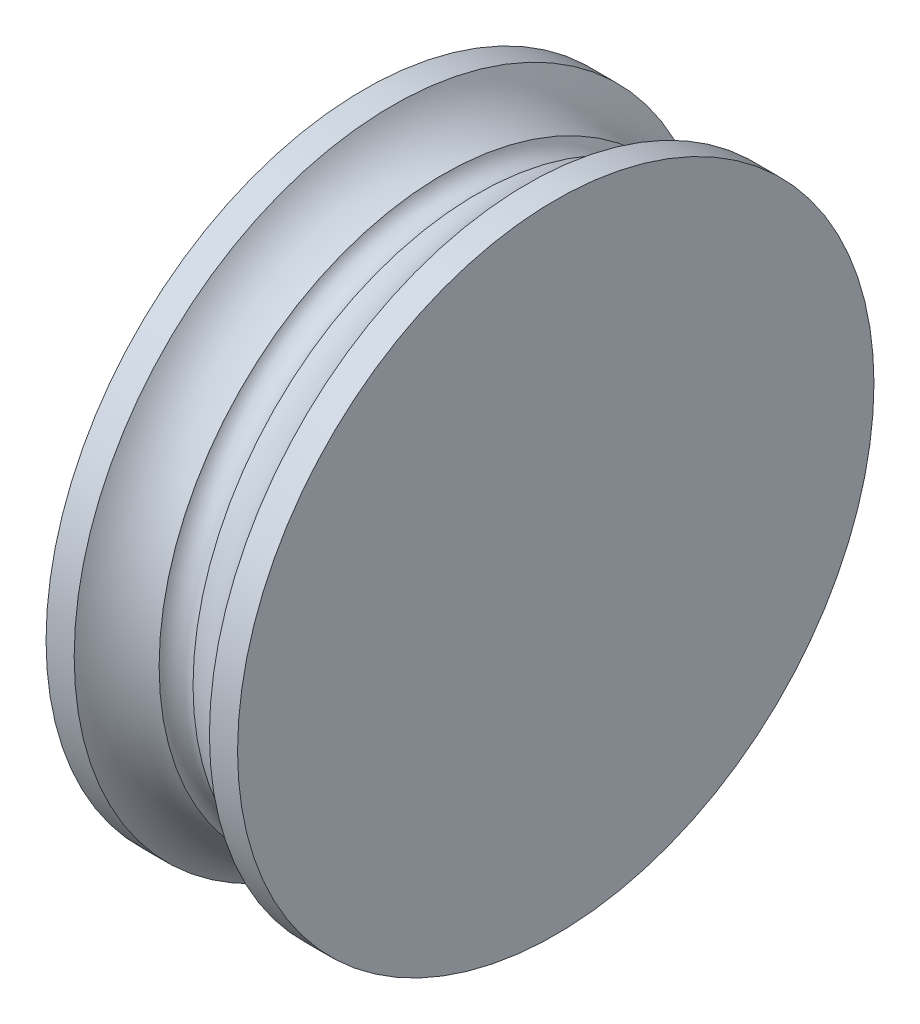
from build123d import *


with BuildPart() as part:
    # Sketch1 → Revolve1 (revolve)
    with BuildSketch(Plane.XY, mode=Mode.PRIVATE) as revolve1_sk:
        with BuildLine():
            Line((8.955, 0), (8.955, 29.76))
            Line((8.955, 29.76), (6.325, 29.76))
            ThreePointArc((6.325, 29.76), (4.312656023, 27.628765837), (1.585, 26.5556489))
            ThreePointArc((1.585, 26.5556489), (0, 25.572352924), (-1.585, 26.5556489))
            ThreePointArc((-1.585, 26.5556489), (-4.312656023, 27.628765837), (-6.325, 29.76))
            Line((-6.325, 29.76), (-8.955, 29.76))
            Line((-8.955, 29.76), (-8.955, 0))
            Line((-8.955, 0), (8.955, 0))
        make_face()
    revolve(revolve1_sk.sketch.rotate(Axis((-8.955, 0, 0), (1, 0, 0)), 90), axis=Axis((-8.955, 0, 0), (1, 0, 0)))


solid = part.part
